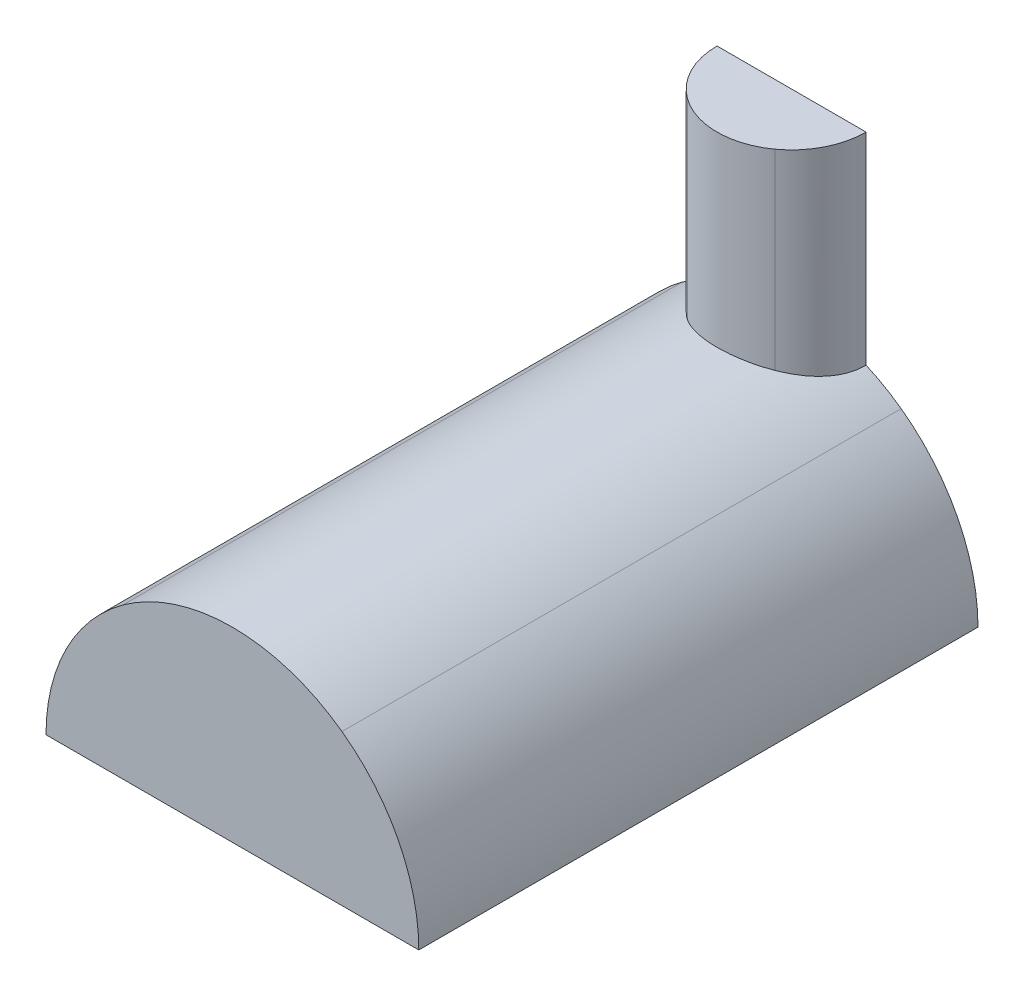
from build123d import *

# Parameters (mm, degrees)
BOSS_EXTRUDE1_DEPTH = 3810
BOSS_EXTRUDE2_DEPTH = 2540


with BuildPart() as part:
    # Sketch1 → Boss-Extrude1 (new body)
    with BuildSketch(Plane.XY):
        with BuildLine():
            Line((-1270, 0), (1270, 0))
            ThreePointArc((1270, 0), (0, 1270), (-1270, 0))
        make_face()
    extrude(amount=BOSS_EXTRUDE1_DEPTH)

    # Sketch2 → Boss-Extrude2 (add)
    with BuildSketch(Plane.XZ):
        with BuildLine():
            Line((508, 0), (-508, 0))
            ThreePointArc((-508, 0), (0, 508), (508, 0))
        make_face()
    extrude(amount=-BOSS_EXTRUDE2_DEPTH)


solid = part.part
